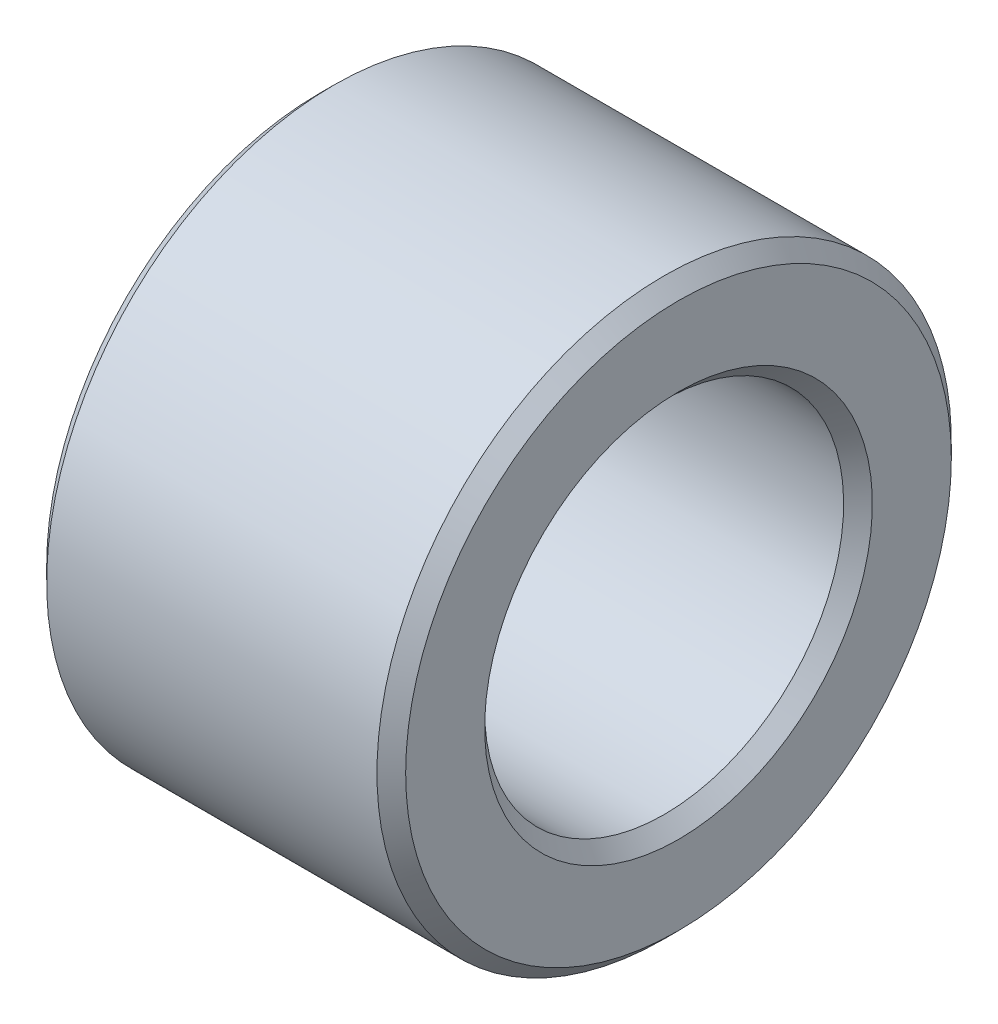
ISO-10303-21;
HEADER;
FILE_DESCRIPTION(('STEP AP214'),'2;1');
FILE_NAME('part.step','',(''),(''),'','','');
FILE_SCHEMA(('AUTOMOTIVE_DESIGN { 1 0 10303 214 1 1 1 1 }'));
ENDSEC;
DATA;
#1=APPLICATION_CONTEXT('core data for automotive mechanical design processes');
#2=APPLICATION_PROTOCOL_DEFINITION('international standard','automotive_design',2000,#1);
#3=PRODUCT_CONTEXT('',#1,'mechanical');
#4=PRODUCT('Part','Part','',(#3));
#5=PRODUCT_RELATED_PRODUCT_CATEGORY('part','',(#4));
#6=PRODUCT_DEFINITION_FORMATION('','',#4);
#7=PRODUCT_DEFINITION_CONTEXT('part definition',#1,'design');
#8=PRODUCT_DEFINITION('design','',#6,#7);
#9=PRODUCT_DEFINITION_SHAPE('','',#8);
#10=(LENGTH_UNIT() NAMED_UNIT(*) SI_UNIT(.MILLI.,.METRE.));
#11=(NAMED_UNIT(*) PLANE_ANGLE_UNIT() SI_UNIT($,.RADIAN.));
#12=(NAMED_UNIT(*) SI_UNIT($,.STERADIAN.) SOLID_ANGLE_UNIT());
#13=UNCERTAINTY_MEASURE_WITH_UNIT(LENGTH_MEASURE(1.E-05),#10,'distance_accuracy_value','');
#14=(GEOMETRIC_REPRESENTATION_CONTEXT(3) GLOBAL_UNCERTAINTY_ASSIGNED_CONTEXT((#13)) GLOBAL_UNIT_ASSIGNED_CONTEXT((#10,
#11,#12)) REPRESENTATION_CONTEXT('',''));
#15=CARTESIAN_POINT('',(0.,0.,0.));
#16=DIRECTION('',(0.,0.,1.));
#17=DIRECTION('',(1.,0.,0.));
#18=AXIS2_PLACEMENT_3D('',#15,#16,#17);
#19=CARTESIAN_POINT('',(0.,-6.5,0.));
#20=DIRECTION('',(-1.,0.,0.));
#21=DIRECTION('',(0.,1.,0.));
#22=AXIS2_PLACEMENT_3D('',#19,#20,#21);
#23=PLANE('',#22);
#24=CARTESIAN_POINT('',(0.,0.,0.));
#25=DIRECTION('',(1.,0.,0.));
#26=DIRECTION('',(0.,-1.,0.));
#27=AXIS2_PLACEMENT_3D('',#24,#25,#26);
#28=CIRCLE('',#27,5.4);
#29=CARTESIAN_POINT('',(0.,-5.4,0.));
#30=VERTEX_POINT('',#29);
#31=EDGE_CURVE('E9',#30,#30,#28,.T.);
#32=ORIENTED_EDGE('',*,*,#31,.T.);
#33=EDGE_LOOP('',(#32));
#34=FACE_BOUND('',#33,.T.);
#35=CARTESIAN_POINT('',(0.,0.,0.));
#36=DIRECTION('',(1.,0.,0.));
#37=DIRECTION('',(0.,-1.,0.));
#38=AXIS2_PLACEMENT_3D('',#35,#36,#37);
#39=CIRCLE('',#38,7.6);
#40=CARTESIAN_POINT('',(0.,-7.6,0.));
#41=VERTEX_POINT('',#40);
#42=EDGE_CURVE('E57',#41,#41,#39,.T.);
#43=ORIENTED_EDGE('',*,*,#42,.F.);
#44=EDGE_LOOP('',(#43));
#45=FACE_BOUND('',#44,.T.);
#46=ADVANCED_FACE('F15',(#34,#45),#23,.T.);
#47=CARTESIAN_POINT('',(0.2,0.,0.));
#48=DIRECTION('',(-1.,0.,0.));
#49=DIRECTION('',(0.,-1.,0.));
#50=AXIS2_PLACEMENT_3D('',#47,#48,#49);
#51=CONICAL_SURFACE('',#50,5.2,0.785398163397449);
#52=CARTESIAN_POINT('',(0.4,0.,0.));
#53=DIRECTION('',(1.,0.,0.));
#54=DIRECTION('',(0.,-1.,0.));
#55=AXIS2_PLACEMENT_3D('',#52,#53,#54);
#56=CIRCLE('',#55,5.);
#57=CARTESIAN_POINT('',(0.4,-5.,0.));
#58=VERTEX_POINT('',#57);
#59=EDGE_CURVE('E25',#58,#58,#56,.T.);
#60=ORIENTED_EDGE('',*,*,#59,.T.);
#61=EDGE_LOOP('',(#60));
#62=FACE_BOUND('',#61,.T.);
#63=ORIENTED_EDGE('',*,*,#31,.F.);
#64=EDGE_LOOP('',(#63));
#65=FACE_BOUND('',#64,.T.);
#66=ADVANCED_FACE('F67',(#62,#65),#51,.F.);
#67=CARTESIAN_POINT('',(5.,0.,0.));
#68=DIRECTION('',(-1.,0.,0.));
#69=DIRECTION('',(0.,-1.,0.));
#70=AXIS2_PLACEMENT_3D('',#67,#68,#69);
#71=CYLINDRICAL_SURFACE('',#70,5.);
#72=CARTESIAN_POINT('',(9.6,0.,0.));
#73=DIRECTION('',(1.,0.,0.));
#74=DIRECTION('',(0.,-1.,0.));
#75=AXIS2_PLACEMENT_3D('',#72,#73,#74);
#76=CIRCLE('',#75,5.);
#77=CARTESIAN_POINT('',(9.6,-5.,0.));
#78=VERTEX_POINT('',#77);
#79=EDGE_CURVE('E64',#78,#78,#76,.T.);
#80=ORIENTED_EDGE('',*,*,#79,.T.);
#81=EDGE_LOOP('',(#80));
#82=FACE_BOUND('',#81,.T.);
#83=ORIENTED_EDGE('',*,*,#59,.F.);
#84=EDGE_LOOP('',(#83));
#85=FACE_BOUND('',#84,.T.);
#86=ADVANCED_FACE('F17',(#82,#85),#71,.F.);
#87=CARTESIAN_POINT('',(9.8,0.,0.));
#88=DIRECTION('',(1.,0.,0.));
#89=DIRECTION('',(0.,-1.,0.));
#90=AXIS2_PLACEMENT_3D('',#87,#88,#89);
#91=CONICAL_SURFACE('',#90,5.2,0.785398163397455);
#92=CARTESIAN_POINT('',(10.,0.,0.));
#93=DIRECTION('',(1.,0.,0.));
#94=DIRECTION('',(0.,-1.,0.));
#95=AXIS2_PLACEMENT_3D('',#92,#93,#94);
#96=CIRCLE('',#95,5.4);
#97=CARTESIAN_POINT('',(10.,-5.4,0.));
#98=VERTEX_POINT('',#97);
#99=EDGE_CURVE('E59',#98,#98,#96,.T.);
#100=ORIENTED_EDGE('',*,*,#99,.T.);
#101=EDGE_LOOP('',(#100));
#102=FACE_BOUND('',#101,.T.);
#103=ORIENTED_EDGE('',*,*,#79,.F.);
#104=EDGE_LOOP('',(#103));
#105=FACE_BOUND('',#104,.T.);
#106=ADVANCED_FACE('F71',(#102,#105),#91,.F.);
#107=CARTESIAN_POINT('',(10.,-6.5,0.));
#108=DIRECTION('',(1.,0.,0.));
#109=DIRECTION('',(0.,-1.,0.));
#110=AXIS2_PLACEMENT_3D('',#107,#108,#109);
#111=PLANE('',#110);
#112=CARTESIAN_POINT('',(10.,0.,0.));
#113=DIRECTION('',(1.,0.,0.));
#114=DIRECTION('',(0.,-1.,0.));
#115=AXIS2_PLACEMENT_3D('',#112,#113,#114);
#116=CIRCLE('',#115,7.6);
#117=CARTESIAN_POINT('',(10.,-7.6,0.));
#118=VERTEX_POINT('',#117);
#119=EDGE_CURVE('E49',#118,#118,#116,.T.);
#120=ORIENTED_EDGE('',*,*,#119,.T.);
#121=EDGE_LOOP('',(#120));
#122=FACE_BOUND('',#121,.T.);
#123=ORIENTED_EDGE('',*,*,#99,.F.);
#124=EDGE_LOOP('',(#123));
#125=FACE_BOUND('',#124,.T.);
#126=ADVANCED_FACE('F78',(#122,#125),#111,.T.);
#127=CARTESIAN_POINT('',(9.8,0.,0.));
#128=DIRECTION('',(-1.,0.,0.));
#129=DIRECTION('',(0.,-1.,0.));
#130=AXIS2_PLACEMENT_3D('',#127,#128,#129);
#131=CONICAL_SURFACE('',#130,7.8,0.785398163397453);
#132=CARTESIAN_POINT('',(9.6,0.,0.));
#133=DIRECTION('',(1.,0.,0.));
#134=DIRECTION('',(0.,-1.,0.));
#135=AXIS2_PLACEMENT_3D('',#132,#133,#134);
#136=CIRCLE('',#135,8.);
#137=CARTESIAN_POINT('',(9.6,-8.,0.));
#138=VERTEX_POINT('',#137);
#139=EDGE_CURVE('E53',#138,#138,#136,.T.);
#140=ORIENTED_EDGE('',*,*,#139,.T.);
#141=EDGE_LOOP('',(#140));
#142=FACE_BOUND('',#141,.T.);
#143=ORIENTED_EDGE('',*,*,#119,.F.);
#144=EDGE_LOOP('',(#143));
#145=FACE_BOUND('',#144,.T.);
#146=ADVANCED_FACE('F54',(#142,#145),#131,.T.);
#147=CARTESIAN_POINT('',(5.,0.,0.));
#148=DIRECTION('',(-1.,0.,0.));
#149=DIRECTION('',(0.,-1.,0.));
#150=AXIS2_PLACEMENT_3D('',#147,#148,#149);
#151=CYLINDRICAL_SURFACE('',#150,8.);
#152=CARTESIAN_POINT('',(0.4,0.,0.));
#153=DIRECTION('',(1.,0.,0.));
#154=DIRECTION('',(0.,-1.,0.));
#155=AXIS2_PLACEMENT_3D('',#152,#153,#154);
#156=CIRCLE('',#155,8.);
#157=CARTESIAN_POINT('',(0.4,-8.,0.));
#158=VERTEX_POINT('',#157);
#159=EDGE_CURVE('E19',#158,#158,#156,.T.);
#160=ORIENTED_EDGE('',*,*,#159,.T.);
#161=EDGE_LOOP('',(#160));
#162=FACE_BOUND('',#161,.T.);
#163=ORIENTED_EDGE('',*,*,#139,.F.);
#164=EDGE_LOOP('',(#163));
#165=FACE_BOUND('',#164,.T.);
#166=ADVANCED_FACE('F91',(#162,#165),#151,.T.);
#167=CARTESIAN_POINT('',(0.2,0.,0.));
#168=DIRECTION('',(1.,0.,0.));
#169=DIRECTION('',(0.,-1.,0.));
#170=AXIS2_PLACEMENT_3D('',#167,#168,#169);
#171=CONICAL_SURFACE('',#170,7.8,0.785398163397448);
#172=ORIENTED_EDGE('',*,*,#42,.T.);
#173=EDGE_LOOP('',(#172));
#174=FACE_BOUND('',#173,.T.);
#175=ORIENTED_EDGE('',*,*,#159,.F.);
#176=EDGE_LOOP('',(#175));
#177=FACE_BOUND('',#176,.T.);
#178=ADVANCED_FACE('F100',(#174,#177),#171,.T.);
#179=CLOSED_SHELL('',(#46,#66,#86,#106,#126,#146,#166,#178));
#180=MANIFOLD_SOLID_BREP('B1',#179);
#181=ADVANCED_BREP_SHAPE_REPRESENTATION('',(#18,#180),#14);
#182=SHAPE_DEFINITION_REPRESENTATION(#9,#181);
ENDSEC;
END-ISO-10303-21;
